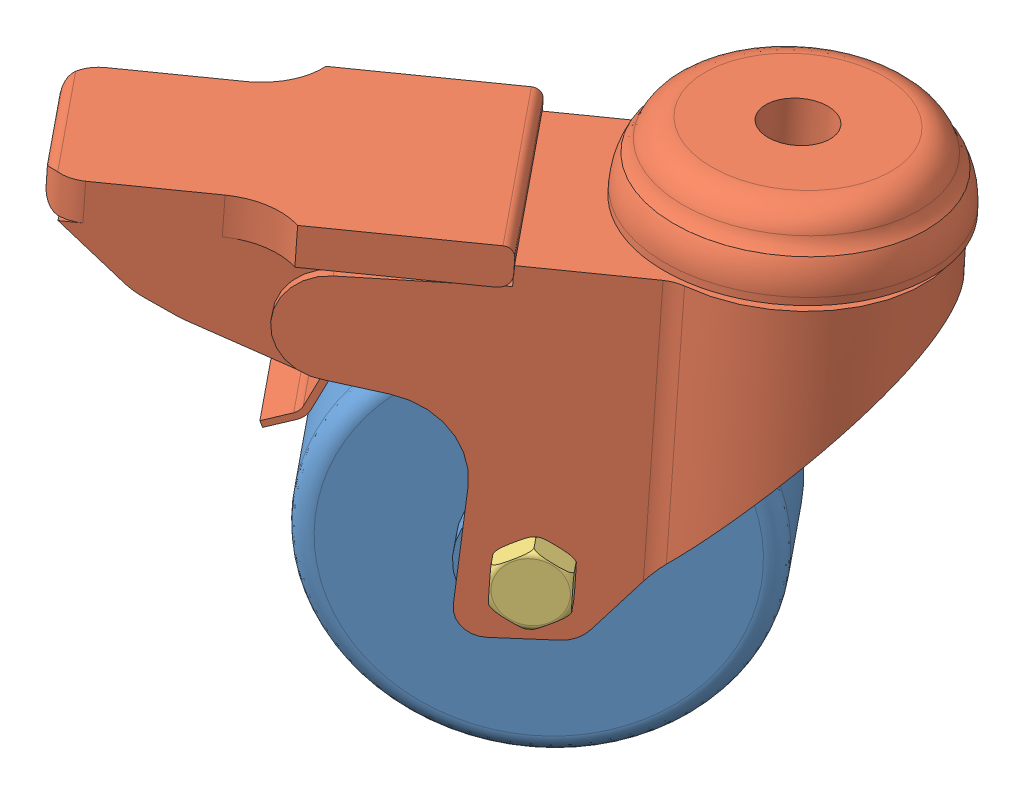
SolidWorks assembly ROULETTE AR ASM.sldasm, configuration Défaut (file format 7000). Lengths in mm.
Overall size (114.99 92.91 108.57).
3 component instances, 3 part files, 4 mates.
Components (placement in the parent):
- ROULETTE AR-1: ROULETTE AR.sldprt [Défaut] at (-72.0735 -80.6089 -8.0549) x (0.772631 -0.051025 -0.632801) z (0.634661 0.037402 0.771885) size (60 60 30)
- CORPS ROULETTE AR-1: CORPS ROULETTE AR.sldprt [Défaut] at (-50.3165 -25.1008 -28.6335) x (0.772631 -0.051025 -0.632801) z (0.634661 0.037402 0.771885) size (111.1 66.71 44.28)
- AXE ROULETTE AR-1: AXE ROULETTE AR.sldprt [Défaut] at (-71.1776 -23.7231 -11.5479) x (0.772631 -0.051025 -0.632801) z (0.634661 0.037402 0.771885) size (11.55 12.08 44.23)
Mates (geometry in assembly coordinates):
- Coaxiale1: concentric aligned: cylinder of CORPS ROULETTE AR-1 through (-86.036 -81.4318 -25.0363) axis (0.634661 0.037402 0.771885) radius 3.15; cylinder of AXE ROULETTE AR-1 through (-88.0669 -81.5514 -27.5064) axis (0.634661 0.037402 0.771885) radius 3
- Coïncidente1: coincident anti-aligned: plane of CORPS ROULETTE AR-1 through (-88.4121 -34.5237 25.17) normal (0.634661 0.037402 0.771885); plane of AXE ROULETTE AR-1 through (-61.2842 -79.9731 5.0672) normal (-0.634661 -0.037402 -0.771885)
- Coaxiale2: concentric aligned: cylinder of ROULETTE AR-1 through (-81.5934 -81.1699 -19.6331) axis (0.634661 0.037402 0.771885) radius 3; cylinder of AXE ROULETTE AR-1 through (-88.0669 -81.5514 -27.5064) axis (0.634661 0.037402 0.771885) radius 3
- Distance1: distance = 0.5 mm anti-aligned: plane of ROULETTE AR-1 through (-62.5536 -80.0479 3.5234) normal (0.634661 0.037402 0.771885); plane of CORPS ROULETTE AR-1 through (-51.3582 -37.0898 -7.1154) normal (-0.634661 -0.037402 -0.771885)
